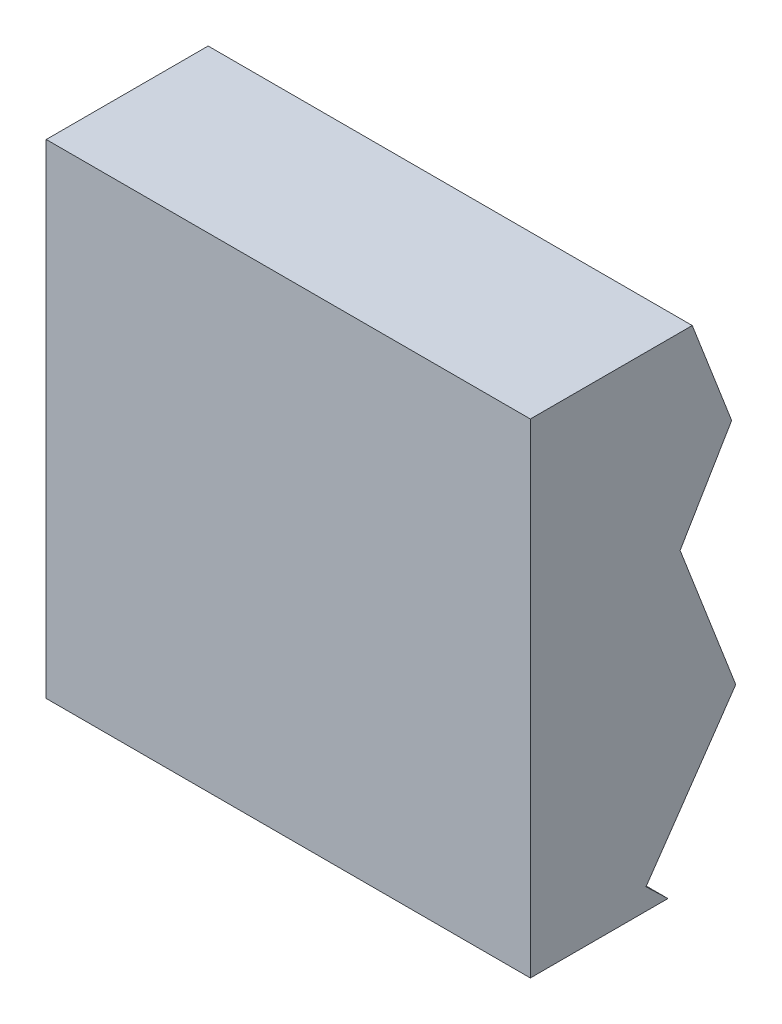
ISO-10303-21;
HEADER;
FILE_DESCRIPTION(('STEP AP214'),'2;1');
FILE_NAME('part.step','',(''),(''),'','','');
FILE_SCHEMA(('AUTOMOTIVE_DESIGN { 1 0 10303 214 1 1 1 1 }'));
ENDSEC;
DATA;
#1=APPLICATION_CONTEXT('core data for automotive mechanical design processes');
#2=APPLICATION_PROTOCOL_DEFINITION('international standard','automotive_design',2000,#1);
#3=PRODUCT_CONTEXT('',#1,'mechanical');
#4=PRODUCT('Part','Part','',(#3));
#5=PRODUCT_RELATED_PRODUCT_CATEGORY('part','',(#4));
#6=PRODUCT_DEFINITION_FORMATION('','',#4);
#7=PRODUCT_DEFINITION_CONTEXT('part definition',#1,'design');
#8=PRODUCT_DEFINITION('design','',#6,#7);
#9=PRODUCT_DEFINITION_SHAPE('','',#8);
#10=(LENGTH_UNIT() NAMED_UNIT(*) SI_UNIT(.MILLI.,.METRE.));
#11=(NAMED_UNIT(*) PLANE_ANGLE_UNIT() SI_UNIT($,.RADIAN.));
#12=(NAMED_UNIT(*) SI_UNIT($,.STERADIAN.) SOLID_ANGLE_UNIT());
#13=UNCERTAINTY_MEASURE_WITH_UNIT(LENGTH_MEASURE(1.E-05),#10,'distance_accuracy_value','');
#14=(GEOMETRIC_REPRESENTATION_CONTEXT(3) GLOBAL_UNCERTAINTY_ASSIGNED_CONTEXT((#13)) GLOBAL_UNIT_ASSIGNED_CONTEXT((#10,
#11,#12)) REPRESENTATION_CONTEXT('',''));
#15=CARTESIAN_POINT('',(0.,0.,0.));
#16=DIRECTION('',(0.,0.,1.));
#17=DIRECTION('',(1.,0.,0.));
#18=AXIS2_PLACEMENT_3D('',#15,#16,#17);
#19=CARTESIAN_POINT('',(50.,-50.,100.));
#20=DIRECTION('',(-1.,0.,0.));
#21=DIRECTION('',(0.,0.,1.));
#22=AXIS2_PLACEMENT_3D('',#19,#20,#21);
#23=PLANE('',#22);
#24=DIRECTION('',(0.,0.,-1.));
#25=VECTOR('',#24,1.);
#26=CARTESIAN_POINT('',(50.,-50.,100.));
#27=LINE('',#26,#25);
#28=CARTESIAN_POINT('',(50.,-50.,100.));
#29=VERTEX_POINT('',#28);
#30=CARTESIAN_POINT('',(50.,-50.,71.5745874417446));
#31=VERTEX_POINT('',#30);
#32=EDGE_CURVE('E179',#29,#31,#27,.T.);
#33=ORIENTED_EDGE('',*,*,#32,.T.);
#34=DIRECTION('',(0.,-0.694356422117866,-0.719631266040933));
#35=VECTOR('',#34,1.);
#36=CARTESIAN_POINT('',(50.,-45.624283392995,76.1095818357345));
#37=LINE('',#36,#35);
#38=CARTESIAN_POINT('',(50.,-45.624283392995,76.1095818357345));
#39=VERTEX_POINT('',#38);
#40=EDGE_CURVE('E49',#39,#31,#37,.T.);
#41=ORIENTED_EDGE('',*,*,#40,.F.);
#42=DIRECTION('',(0.,-0.823442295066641,0.567400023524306));
#43=VECTOR('',#42,1.);
#44=CARTESIAN_POINT('',(50.,-18.7217324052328,57.5721467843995));
#45=LINE('',#44,#43);
#46=CARTESIAN_POINT('',(50.,-18.7217324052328,57.5721467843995));
#47=VERTEX_POINT('',#46);
#48=EDGE_CURVE('E278',#47,#39,#45,.T.);
#49=ORIENTED_EDGE('',*,*,#48,.F.);
#50=DIRECTION('',(0.,-0.932741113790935,-0.360546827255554));
#51=VECTOR('',#50,1.);
#52=CARTESIAN_POINT('',(50.,11.0146765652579,69.0666201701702));
#53=LINE('',#52,#51);
#54=CARTESIAN_POINT('',(50.,11.0146765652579,69.0666201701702));
#55=VERTEX_POINT('',#54);
#56=EDGE_CURVE('E275',#55,#47,#53,.T.);
#57=ORIENTED_EDGE('',*,*,#56,.F.);
#58=DIRECTION('',(0.,-0.859884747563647,0.510488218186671));
#59=VECTOR('',#58,1.);
#60=CARTESIAN_POINT('',(50.,28.9465108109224,58.421018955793));
#61=LINE('',#60,#59);
#62=CARTESIAN_POINT('',(50.,28.9465108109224,58.421018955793));
#63=VERTEX_POINT('',#62);
#64=EDGE_CURVE('E272',#63,#55,#61,.T.);
#65=ORIENTED_EDGE('',*,*,#64,.F.);
#66=DIRECTION('',(0.,-0.932741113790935,-0.360546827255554));
#67=VECTOR('',#66,1.);
#68=CARTESIAN_POINT('',(50.,50.,66.5591492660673));
#69=LINE('',#68,#67);
#70=CARTESIAN_POINT('',(50.,50.,66.5591492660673));
#71=VERTEX_POINT('',#70);
#72=EDGE_CURVE('E270',#71,#63,#69,.T.);
#73=ORIENTED_EDGE('',*,*,#72,.F.);
#74=DIRECTION('',(0.,0.,-1.));
#75=VECTOR('',#74,1.);
#76=CARTESIAN_POINT('',(50.,50.,100.));
#77=LINE('',#76,#75);
#78=CARTESIAN_POINT('',(50.,50.,100.));
#79=VERTEX_POINT('',#78);
#80=EDGE_CURVE('E166',#79,#71,#77,.T.);
#81=ORIENTED_EDGE('',*,*,#80,.F.);
#82=DIRECTION('',(0.,1.,0.));
#83=VECTOR('',#82,1.);
#84=CARTESIAN_POINT('',(50.,-50.,100.));
#85=LINE('',#84,#83);
#86=EDGE_CURVE('E232',#29,#79,#85,.T.);
#87=ORIENTED_EDGE('',*,*,#86,.F.);
#88=EDGE_LOOP('',(#33,#41,#49,#57,#65,#73,#81,#87));
#89=FACE_BOUND('',#88,.T.);
#90=ADVANCED_FACE('F35',(#89),#23,.F.);
#91=CARTESIAN_POINT('',(-50.,50.,100.));
#92=DIRECTION('',(0.,-1.,0.));
#93=DIRECTION('',(0.,0.,-1.));
#94=AXIS2_PLACEMENT_3D('',#91,#92,#93);
#95=PLANE('',#94);
#96=ORIENTED_EDGE('',*,*,#80,.T.);
#97=DIRECTION('',(1.,0.,0.));
#98=VECTOR('',#97,1.);
#99=CARTESIAN_POINT('',(-50.,50.,66.5591492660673));
#100=LINE('',#99,#98);
#101=CARTESIAN_POINT('',(-50.,50.,66.5591492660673));
#102=VERTEX_POINT('',#101);
#103=EDGE_CURVE('E149',#102,#71,#100,.T.);
#104=ORIENTED_EDGE('',*,*,#103,.F.);
#105=DIRECTION('',(0.,0.,-1.));
#106=VECTOR('',#105,1.);
#107=CARTESIAN_POINT('',(-50.,50.,100.));
#108=LINE('',#107,#106);
#109=CARTESIAN_POINT('',(-50.,50.,100.));
#110=VERTEX_POINT('',#109);
#111=EDGE_CURVE('E163',#110,#102,#108,.T.);
#112=ORIENTED_EDGE('',*,*,#111,.F.);
#113=DIRECTION('',(-1.,0.,0.));
#114=VECTOR('',#113,1.);
#115=CARTESIAN_POINT('',(-50.,50.,100.));
#116=LINE('',#115,#114);
#117=EDGE_CURVE('E250',#79,#110,#116,.T.);
#118=ORIENTED_EDGE('',*,*,#117,.F.);
#119=EDGE_LOOP('',(#96,#104,#112,#118));
#120=FACE_BOUND('',#119,.T.);
#121=ADVANCED_FACE('F162',(#120),#95,.F.);
#122=CARTESIAN_POINT('',(-50.,-50.,100.));
#123=DIRECTION('',(1.,0.,0.));
#124=DIRECTION('',(0.,0.,-1.));
#125=AXIS2_PLACEMENT_3D('',#122,#123,#124);
#126=PLANE('',#125);
#127=DIRECTION('',(0.,-0.823442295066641,0.567400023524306));
#128=VECTOR('',#127,1.);
#129=CARTESIAN_POINT('',(-50.,-18.7217324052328,57.5721467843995));
#130=LINE('',#129,#128);
#131=CARTESIAN_POINT('',(-50.,-18.7217324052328,57.5721467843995));
#132=VERTEX_POINT('',#131);
#133=CARTESIAN_POINT('',(-50.,-45.624283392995,76.1095818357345));
#134=VERTEX_POINT('',#133);
#135=EDGE_CURVE('E201',#132,#134,#130,.T.);
#136=ORIENTED_EDGE('',*,*,#135,.T.);
#137=DIRECTION('',(0.,-0.694356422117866,-0.719631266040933));
#138=VECTOR('',#137,1.);
#139=CARTESIAN_POINT('',(-50.,-45.624283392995,76.1095818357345));
#140=LINE('',#139,#138);
#141=CARTESIAN_POINT('',(-50.,-50.,71.5745874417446));
#142=VERTEX_POINT('',#141);
#143=EDGE_CURVE('E168',#134,#142,#140,.T.);
#144=ORIENTED_EDGE('',*,*,#143,.T.);
#145=DIRECTION('',(0.,0.,-1.));
#146=VECTOR('',#145,1.);
#147=CARTESIAN_POINT('',(-50.,-50.,100.));
#148=LINE('',#147,#146);
#149=CARTESIAN_POINT('',(-50.,-50.,100.));
#150=VERTEX_POINT('',#149);
#151=EDGE_CURVE('E174',#150,#142,#148,.T.);
#152=ORIENTED_EDGE('',*,*,#151,.F.);
#153=DIRECTION('',(0.,-1.,0.));
#154=VECTOR('',#153,1.);
#155=CARTESIAN_POINT('',(-50.,-50.,100.));
#156=LINE('',#155,#154);
#157=EDGE_CURVE('E173',#110,#150,#156,.T.);
#158=ORIENTED_EDGE('',*,*,#157,.F.);
#159=ORIENTED_EDGE('',*,*,#111,.T.);
#160=DIRECTION('',(0.,-0.932741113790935,-0.360546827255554));
#161=VECTOR('',#160,1.);
#162=CARTESIAN_POINT('',(-50.,50.,66.5591492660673));
#163=LINE('',#162,#161);
#164=CARTESIAN_POINT('',(-50.,28.9465108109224,58.421018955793));
#165=VERTEX_POINT('',#164);
#166=EDGE_CURVE('E145',#102,#165,#163,.T.);
#167=ORIENTED_EDGE('',*,*,#166,.T.);
#168=DIRECTION('',(0.,-0.859884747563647,0.510488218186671));
#169=VECTOR('',#168,1.);
#170=CARTESIAN_POINT('',(-50.,28.9465108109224,58.421018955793));
#171=LINE('',#170,#169);
#172=CARTESIAN_POINT('',(-50.,11.0146765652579,69.0666201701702));
#173=VERTEX_POINT('',#172);
#174=EDGE_CURVE('E157',#165,#173,#171,.T.);
#175=ORIENTED_EDGE('',*,*,#174,.T.);
#176=DIRECTION('',(0.,-0.932741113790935,-0.360546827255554));
#177=VECTOR('',#176,1.);
#178=CARTESIAN_POINT('',(-50.,11.0146765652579,69.0666201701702));
#179=LINE('',#178,#177);
#180=EDGE_CURVE('E266',#173,#132,#179,.T.);
#181=ORIENTED_EDGE('',*,*,#180,.T.);
#182=EDGE_LOOP('',(#136,#144,#152,#158,#159,#167,#175,#181));
#183=FACE_BOUND('',#182,.T.);
#184=ADVANCED_FACE('F171',(#183),#126,.F.);
#185=CARTESIAN_POINT('',(-50.,-50.,100.));
#186=DIRECTION('',(0.,1.,0.));
#187=DIRECTION('',(0.,0.,1.));
#188=AXIS2_PLACEMENT_3D('',#185,#186,#187);
#189=PLANE('',#188);
#190=ORIENTED_EDGE('',*,*,#151,.T.);
#191=DIRECTION('',(1.,0.,0.));
#192=VECTOR('',#191,1.);
#193=CARTESIAN_POINT('',(-50.,-50.,71.5745874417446));
#194=LINE('',#193,#192);
#195=EDGE_CURVE('E211',#142,#31,#194,.T.);
#196=ORIENTED_EDGE('',*,*,#195,.T.);
#197=ORIENTED_EDGE('',*,*,#32,.F.);
#198=DIRECTION('',(1.,0.,0.));
#199=VECTOR('',#198,1.);
#200=CARTESIAN_POINT('',(-50.,-50.,100.));
#201=LINE('',#200,#199);
#202=EDGE_CURVE('E253',#150,#29,#201,.T.);
#203=ORIENTED_EDGE('',*,*,#202,.F.);
#204=EDGE_LOOP('',(#190,#196,#197,#203));
#205=FACE_BOUND('',#204,.T.);
#206=ADVANCED_FACE('F261',(#205),#189,.F.);
#207=CARTESIAN_POINT('',(50.,50.,100.));
#208=DIRECTION('',(0.,0.,-1.));
#209=DIRECTION('',(-1.,0.,0.));
#210=AXIS2_PLACEMENT_3D('',#207,#208,#209);
#211=PLANE('',#210);
#212=ORIENTED_EDGE('',*,*,#86,.T.);
#213=ORIENTED_EDGE('',*,*,#117,.T.);
#214=ORIENTED_EDGE('',*,*,#157,.T.);
#215=ORIENTED_EDGE('',*,*,#202,.T.);
#216=EDGE_LOOP('',(#212,#213,#214,#215));
#217=FACE_BOUND('',#216,.T.);
#218=ADVANCED_FACE('F319',(#217),#211,.F.);
#219=CARTESIAN_POINT('',(-50.,-18.7217324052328,57.5721467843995));
#220=DIRECTION('',(0.,0.567400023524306,0.823442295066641));
#221=DIRECTION('',(0.,-0.823442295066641,0.567400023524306));
#222=AXIS2_PLACEMENT_3D('',#219,#220,#221);
#223=PLANE('',#222);
#224=DIRECTION('',(0.,0.823442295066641,-0.567400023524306));
#225=VECTOR('',#224,1.);
#226=CARTESIAN_POINT('',(49.,-59.7533789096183,85.8453571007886));
#227=LINE('',#226,#225);
#228=CARTESIAN_POINT('',(49.,-45.624283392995,76.1095818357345));
#229=VERTEX_POINT('',#228);
#230=CARTESIAN_POINT('',(49.,-18.7217324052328,57.5721467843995));
#231=VERTEX_POINT('',#230);
#232=EDGE_CURVE('E226',#229,#231,#227,.T.);
#233=ORIENTED_EDGE('',*,*,#232,.T.);
#234=DIRECTION('',(1.,0.,0.));
#235=VECTOR('',#234,1.);
#236=CARTESIAN_POINT('',(-50.,-18.7217324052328,57.5721467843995));
#237=LINE('',#236,#235);
#238=EDGE_CURVE('E204',#231,#47,#237,.T.);
#239=ORIENTED_EDGE('',*,*,#238,.T.);
#240=ORIENTED_EDGE('',*,*,#48,.T.);
#241=DIRECTION('',(1.,0.,0.));
#242=VECTOR('',#241,1.);
#243=CARTESIAN_POINT('',(-50.,-45.624283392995,76.1095818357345));
#244=LINE('',#243,#242);
#245=EDGE_CURVE('E203',#229,#39,#244,.T.);
#246=ORIENTED_EDGE('',*,*,#245,.F.);
#247=EDGE_LOOP('',(#233,#239,#240,#246));
#248=FACE_BOUND('',#247,.T.);
#249=ADVANCED_FACE('F317',(#248),#223,.F.);
#250=CARTESIAN_POINT('',(-50.,11.0146765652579,69.0666201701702));
#251=DIRECTION('',(0.,-0.360546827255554,0.932741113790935));
#252=DIRECTION('',(0.,-0.932741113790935,-0.360546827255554));
#253=AXIS2_PLACEMENT_3D('',#250,#251,#252);
#254=PLANE('',#253);
#255=DIRECTION('',(0.,0.932741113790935,0.360546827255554));
#256=VECTOR('',#255,1.);
#257=CARTESIAN_POINT('',(49.,-31.6656590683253,52.5687309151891));
#258=LINE('',#257,#256);
#259=CARTESIAN_POINT('',(49.,11.0146765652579,69.0666201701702));
#260=VERTEX_POINT('',#259);
#261=EDGE_CURVE('E224',#231,#260,#258,.T.);
#262=ORIENTED_EDGE('',*,*,#261,.T.);
#263=DIRECTION('',(1.,0.,0.));
#264=VECTOR('',#263,1.);
#265=CARTESIAN_POINT('',(-50.,11.0146765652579,69.0666201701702));
#266=LINE('',#265,#264);
#267=EDGE_CURVE('E283',#260,#55,#266,.T.);
#268=ORIENTED_EDGE('',*,*,#267,.T.);
#269=ORIENTED_EDGE('',*,*,#56,.T.);
#270=ORIENTED_EDGE('',*,*,#238,.F.);
#271=EDGE_LOOP('',(#262,#268,#269,#270));
#272=FACE_BOUND('',#271,.T.);
#273=ADVANCED_FACE('F295',(#272),#254,.F.);
#274=CARTESIAN_POINT('',(-50.,28.9465108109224,58.421018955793));
#275=DIRECTION('',(0.,0.510488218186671,0.859884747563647));
#276=DIRECTION('',(0.,-0.859884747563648,0.510488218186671));
#277=AXIS2_PLACEMENT_3D('',#274,#275,#276);
#278=PLANE('',#277);
#279=DIRECTION('',(0.,0.859884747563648,-0.510488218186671));
#280=VECTOR('',#279,1.);
#281=CARTESIAN_POINT('',(49.,-47.6782321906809,103.910869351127));
#282=LINE('',#281,#280);
#283=CARTESIAN_POINT('',(49.,28.9465108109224,58.421018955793));
#284=VERTEX_POINT('',#283);
#285=EDGE_CURVE('E222',#260,#284,#282,.T.);
#286=ORIENTED_EDGE('',*,*,#285,.T.);
#287=DIRECTION('',(1.,0.,0.));
#288=VECTOR('',#287,1.);
#289=CARTESIAN_POINT('',(-50.,28.9465108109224,58.421018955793));
#290=LINE('',#289,#288);
#291=EDGE_CURVE('E167',#284,#63,#290,.T.);
#292=ORIENTED_EDGE('',*,*,#291,.T.);
#293=ORIENTED_EDGE('',*,*,#64,.T.);
#294=ORIENTED_EDGE('',*,*,#267,.F.);
#295=EDGE_LOOP('',(#286,#292,#293,#294));
#296=FACE_BOUND('',#295,.T.);
#297=ADVANCED_FACE('F287',(#296),#278,.F.);
#298=CARTESIAN_POINT('',(-50.,-45.624283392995,76.1095818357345));
#299=DIRECTION('',(0.,-0.719631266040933,0.694356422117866));
#300=DIRECTION('',(0.,-0.694356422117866,-0.719631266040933));
#301=AXIS2_PLACEMENT_3D('',#298,#299,#300);
#302=PLANE('',#301);
#303=DIRECTION('',(0.,0.694356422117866,0.719631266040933));
#304=VECTOR('',#303,1.);
#305=CARTESIAN_POINT('',(49.,-35.7963730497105,86.2952319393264));
#306=LINE('',#305,#304);
#307=CARTESIAN_POINT('',(49.,-49.,72.6109878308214));
#308=VERTEX_POINT('',#307);
#309=EDGE_CURVE('E210',#308,#229,#306,.T.);
#310=ORIENTED_EDGE('',*,*,#309,.T.);
#311=ORIENTED_EDGE('',*,*,#245,.T.);
#312=ORIENTED_EDGE('',*,*,#40,.T.);
#313=ORIENTED_EDGE('',*,*,#195,.F.);
#314=ORIENTED_EDGE('',*,*,#143,.F.);
#315=CARTESIAN_POINT('',(-49.,-45.624283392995,76.1095818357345));
#316=VERTEX_POINT('',#315);
#317=EDGE_CURVE('E215',#134,#316,#244,.T.);
#318=ORIENTED_EDGE('',*,*,#317,.T.);
#319=DIRECTION('',(0.,-0.694356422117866,-0.719631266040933));
#320=VECTOR('',#319,1.);
#321=CARTESIAN_POINT('',(-49.,-35.7963730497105,86.2952319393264));
#322=LINE('',#321,#320);
#323=CARTESIAN_POINT('',(-49.,-49.,72.6109878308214));
#324=VERTEX_POINT('',#323);
#325=EDGE_CURVE('E56',#316,#324,#322,.T.);
#326=ORIENTED_EDGE('',*,*,#325,.T.);
#327=DIRECTION('',(1.,0.,0.));
#328=VECTOR('',#327,1.);
#329=CARTESIAN_POINT('',(-50.,-49.,72.6109878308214));
#330=LINE('',#329,#328);
#331=EDGE_CURVE('E176',#324,#308,#330,.T.);
#332=ORIENTED_EDGE('',*,*,#331,.T.);
#333=EDGE_LOOP('',(#310,#311,#312,#313,#314,#318,#326,#332));
#334=FACE_BOUND('',#333,.T.);
#335=ADVANCED_FACE('F264',(#334),#302,.F.);
#336=DIRECTION('',(0.,-0.823442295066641,0.567400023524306));
#337=VECTOR('',#336,1.);
#338=CARTESIAN_POINT('',(-49.,-59.7533789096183,85.8453571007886));
#339=LINE('',#338,#337);
#340=CARTESIAN_POINT('',(-49.,-18.7217324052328,57.5721467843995));
#341=VERTEX_POINT('',#340);
#342=EDGE_CURVE('E11',#341,#316,#339,.T.);
#343=ORIENTED_EDGE('',*,*,#342,.T.);
#344=ORIENTED_EDGE('',*,*,#317,.F.);
#345=ORIENTED_EDGE('',*,*,#135,.F.);
#346=EDGE_CURVE('E193',#132,#341,#237,.T.);
#347=ORIENTED_EDGE('',*,*,#346,.T.);
#348=EDGE_LOOP('',(#343,#344,#345,#347));
#349=FACE_BOUND('',#348,.T.);
#350=ADVANCED_FACE('F200',(#349),#223,.F.);
#351=DIRECTION('',(0.,-0.932741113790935,-0.360546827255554));
#352=VECTOR('',#351,1.);
#353=CARTESIAN_POINT('',(-49.,-31.6656590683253,52.5687309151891));
#354=LINE('',#353,#352);
#355=CARTESIAN_POINT('',(-49.,11.0146765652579,69.0666201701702));
#356=VERTEX_POINT('',#355);
#357=EDGE_CURVE('E42',#356,#341,#354,.T.);
#358=ORIENTED_EDGE('',*,*,#357,.T.);
#359=ORIENTED_EDGE('',*,*,#346,.F.);
#360=ORIENTED_EDGE('',*,*,#180,.F.);
#361=EDGE_CURVE('E195',#173,#356,#266,.T.);
#362=ORIENTED_EDGE('',*,*,#361,.T.);
#363=EDGE_LOOP('',(#358,#359,#360,#362));
#364=FACE_BOUND('',#363,.T.);
#365=ADVANCED_FACE('F191',(#364),#254,.F.);
#366=DIRECTION('',(0.,-0.859884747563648,0.510488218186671));
#367=VECTOR('',#366,1.);
#368=CARTESIAN_POINT('',(-49.,-47.6782321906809,103.910869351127));
#369=LINE('',#368,#367);
#370=CARTESIAN_POINT('',(-49.,28.9465108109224,58.421018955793));
#371=VERTEX_POINT('',#370);
#372=EDGE_CURVE('E186',#371,#356,#369,.T.);
#373=ORIENTED_EDGE('',*,*,#372,.T.);
#374=ORIENTED_EDGE('',*,*,#361,.F.);
#375=ORIENTED_EDGE('',*,*,#174,.F.);
#376=EDGE_CURVE('E152',#165,#371,#290,.T.);
#377=ORIENTED_EDGE('',*,*,#376,.T.);
#378=EDGE_LOOP('',(#373,#374,#375,#377));
#379=FACE_BOUND('',#378,.T.);
#380=ADVANCED_FACE('F353',(#379),#278,.F.);
#381=CARTESIAN_POINT('',(-50.,50.,66.5591492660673));
#382=DIRECTION('',(0.,-0.360546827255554,0.932741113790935));
#383=DIRECTION('',(0.,-0.932741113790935,-0.360546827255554));
#384=AXIS2_PLACEMENT_3D('',#381,#382,#383);
#385=PLANE('',#384);
#386=DIRECTION('',(0.,0.932741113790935,0.360546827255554));
#387=VECTOR('',#386,1.);
#388=CARTESIAN_POINT('',(49.,-25.7545457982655,37.2765747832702));
#389=LINE('',#388,#387);
#390=CARTESIAN_POINT('',(49.,49.,66.1726038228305));
#391=VERTEX_POINT('',#390);
#392=EDGE_CURVE('E220',#284,#391,#389,.T.);
#393=ORIENTED_EDGE('',*,*,#392,.T.);
#394=DIRECTION('',(-1.,0.,0.));
#395=VECTOR('',#394,1.);
#396=CARTESIAN_POINT('',(-50.,49.,66.1726038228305));
#397=LINE('',#396,#395);
#398=CARTESIAN_POINT('',(-49.,49.,66.1726038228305));
#399=VERTEX_POINT('',#398);
#400=EDGE_CURVE('E213',#391,#399,#397,.T.);
#401=ORIENTED_EDGE('',*,*,#400,.T.);
#402=DIRECTION('',(0.,-0.932741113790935,-0.360546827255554));
#403=VECTOR('',#402,1.);
#404=CARTESIAN_POINT('',(-49.,-25.7545457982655,37.2765747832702));
#405=LINE('',#404,#403);
#406=EDGE_CURVE('E184',#399,#371,#405,.T.);
#407=ORIENTED_EDGE('',*,*,#406,.T.);
#408=ORIENTED_EDGE('',*,*,#376,.F.);
#409=ORIENTED_EDGE('',*,*,#166,.F.);
#410=ORIENTED_EDGE('',*,*,#103,.T.);
#411=ORIENTED_EDGE('',*,*,#72,.T.);
#412=ORIENTED_EDGE('',*,*,#291,.F.);
#413=EDGE_LOOP('',(#393,#401,#407,#408,#409,#410,#411,#412));
#414=FACE_BOUND('',#413,.T.);
#415=ADVANCED_FACE('F147',(#414),#385,.F.);
#416=CARTESIAN_POINT('',(50.,50.,99.));
#417=DIRECTION('',(0.,0.,-1.));
#418=DIRECTION('',(-1.,0.,0.));
#419=AXIS2_PLACEMENT_3D('',#416,#417,#418);
#420=PLANE('',#419);
#421=DIRECTION('',(0.,1.,0.));
#422=VECTOR('',#421,1.);
#423=CARTESIAN_POINT('',(49.,50.,99.));
#424=LINE('',#423,#422);
#425=CARTESIAN_POINT('',(49.,-49.,99.));
#426=VERTEX_POINT('',#425);
#427=CARTESIAN_POINT('',(49.,49.,99.));
#428=VERTEX_POINT('',#427);
#429=EDGE_CURVE('E228',#426,#428,#424,.T.);
#430=ORIENTED_EDGE('',*,*,#429,.F.);
#431=DIRECTION('',(1.,0.,0.));
#432=VECTOR('',#431,1.);
#433=CARTESIAN_POINT('',(50.,-49.,99.));
#434=LINE('',#433,#432);
#435=CARTESIAN_POINT('',(-49.,-49.,99.));
#436=VERTEX_POINT('',#435);
#437=EDGE_CURVE('E240',#436,#426,#434,.T.);
#438=ORIENTED_EDGE('',*,*,#437,.F.);
#439=DIRECTION('',(0.,-1.,0.));
#440=VECTOR('',#439,1.);
#441=CARTESIAN_POINT('',(-49.,50.,99.));
#442=LINE('',#441,#440);
#443=CARTESIAN_POINT('',(-49.,49.,99.));
#444=VERTEX_POINT('',#443);
#445=EDGE_CURVE('E244',#444,#436,#442,.T.);
#446=ORIENTED_EDGE('',*,*,#445,.F.);
#447=DIRECTION('',(-1.,0.,0.));
#448=VECTOR('',#447,1.);
#449=CARTESIAN_POINT('',(50.,49.,99.));
#450=LINE('',#449,#448);
#451=EDGE_CURVE('E236',#428,#444,#450,.T.);
#452=ORIENTED_EDGE('',*,*,#451,.F.);
#453=EDGE_LOOP('',(#430,#438,#446,#452));
#454=FACE_BOUND('',#453,.T.);
#455=ADVANCED_FACE('F311',(#454),#420,.T.);
#456=CARTESIAN_POINT('',(-50.,-49.,100.));
#457=DIRECTION('',(0.,1.,0.));
#458=DIRECTION('',(0.,0.,1.));
#459=AXIS2_PLACEMENT_3D('',#456,#457,#458);
#460=PLANE('',#459);
#461=ORIENTED_EDGE('',*,*,#331,.F.);
#462=DIRECTION('',(0.,0.,-1.));
#463=VECTOR('',#462,1.);
#464=CARTESIAN_POINT('',(-49.,-49.,100.));
#465=LINE('',#464,#463);
#466=EDGE_CURVE('E209',#436,#324,#465,.T.);
#467=ORIENTED_EDGE('',*,*,#466,.F.);
#468=ORIENTED_EDGE('',*,*,#437,.T.);
#469=DIRECTION('',(0.,0.,-1.));
#470=VECTOR('',#469,1.);
#471=CARTESIAN_POINT('',(49.,-49.,100.));
#472=LINE('',#471,#470);
#473=EDGE_CURVE('E237',#426,#308,#472,.T.);
#474=ORIENTED_EDGE('',*,*,#473,.T.);
#475=EDGE_LOOP('',(#461,#467,#468,#474));
#476=FACE_BOUND('',#475,.T.);
#477=ADVANCED_FACE('F314',(#476),#460,.T.);
#478=CARTESIAN_POINT('',(-49.,-50.,100.));
#479=DIRECTION('',(1.,0.,0.));
#480=DIRECTION('',(0.,0.,-1.));
#481=AXIS2_PLACEMENT_3D('',#478,#479,#480);
#482=PLANE('',#481);
#483=ORIENTED_EDGE('',*,*,#325,.F.);
#484=ORIENTED_EDGE('',*,*,#342,.F.);
#485=ORIENTED_EDGE('',*,*,#357,.F.);
#486=ORIENTED_EDGE('',*,*,#372,.F.);
#487=ORIENTED_EDGE('',*,*,#406,.F.);
#488=DIRECTION('',(0.,0.,-1.));
#489=VECTOR('',#488,1.);
#490=CARTESIAN_POINT('',(-49.,49.,100.));
#491=LINE('',#490,#489);
#492=EDGE_CURVE('E233',#444,#399,#491,.T.);
#493=ORIENTED_EDGE('',*,*,#492,.F.);
#494=ORIENTED_EDGE('',*,*,#445,.T.);
#495=ORIENTED_EDGE('',*,*,#466,.T.);
#496=EDGE_LOOP('',(#483,#484,#485,#486,#487,#493,#494,#495));
#497=FACE_BOUND('',#496,.T.);
#498=ADVANCED_FACE('F206',(#497),#482,.T.);
#499=CARTESIAN_POINT('',(-50.,49.,100.));
#500=DIRECTION('',(0.,-1.,0.));
#501=DIRECTION('',(0.,0.,-1.));
#502=AXIS2_PLACEMENT_3D('',#499,#500,#501);
#503=PLANE('',#502);
#504=ORIENTED_EDGE('',*,*,#400,.F.);
#505=DIRECTION('',(0.,0.,-1.));
#506=VECTOR('',#505,1.);
#507=CARTESIAN_POINT('',(49.,49.,100.));
#508=LINE('',#507,#506);
#509=EDGE_CURVE('E229',#428,#391,#508,.T.);
#510=ORIENTED_EDGE('',*,*,#509,.F.);
#511=ORIENTED_EDGE('',*,*,#451,.T.);
#512=ORIENTED_EDGE('',*,*,#492,.T.);
#513=EDGE_LOOP('',(#504,#510,#511,#512));
#514=FACE_BOUND('',#513,.T.);
#515=ADVANCED_FACE('F305',(#514),#503,.T.);
#516=CARTESIAN_POINT('',(49.,-50.,100.));
#517=DIRECTION('',(-1.,0.,0.));
#518=DIRECTION('',(0.,0.,1.));
#519=AXIS2_PLACEMENT_3D('',#516,#517,#518);
#520=PLANE('',#519);
#521=ORIENTED_EDGE('',*,*,#309,.F.);
#522=ORIENTED_EDGE('',*,*,#473,.F.);
#523=ORIENTED_EDGE('',*,*,#429,.T.);
#524=ORIENTED_EDGE('',*,*,#509,.T.);
#525=ORIENTED_EDGE('',*,*,#392,.F.);
#526=ORIENTED_EDGE('',*,*,#285,.F.);
#527=ORIENTED_EDGE('',*,*,#261,.F.);
#528=ORIENTED_EDGE('',*,*,#232,.F.);
#529=EDGE_LOOP('',(#521,#522,#523,#524,#525,#526,#527,#528));
#530=FACE_BOUND('',#529,.T.);
#531=ADVANCED_FACE('F299',(#530),#520,.T.);
#532=CLOSED_SHELL('',(#90,#121,#184,#206,#218,#249,#273,#297,#335,#350,#365,#380,#415,#455,#477,
#498,#515,#531));
#533=MANIFOLD_SOLID_BREP('B2',#532);
#534=ADVANCED_BREP_SHAPE_REPRESENTATION('',(#18,#533),#14);
#535=SHAPE_DEFINITION_REPRESENTATION(#9,#534);
ENDSEC;
END-ISO-10303-21;
